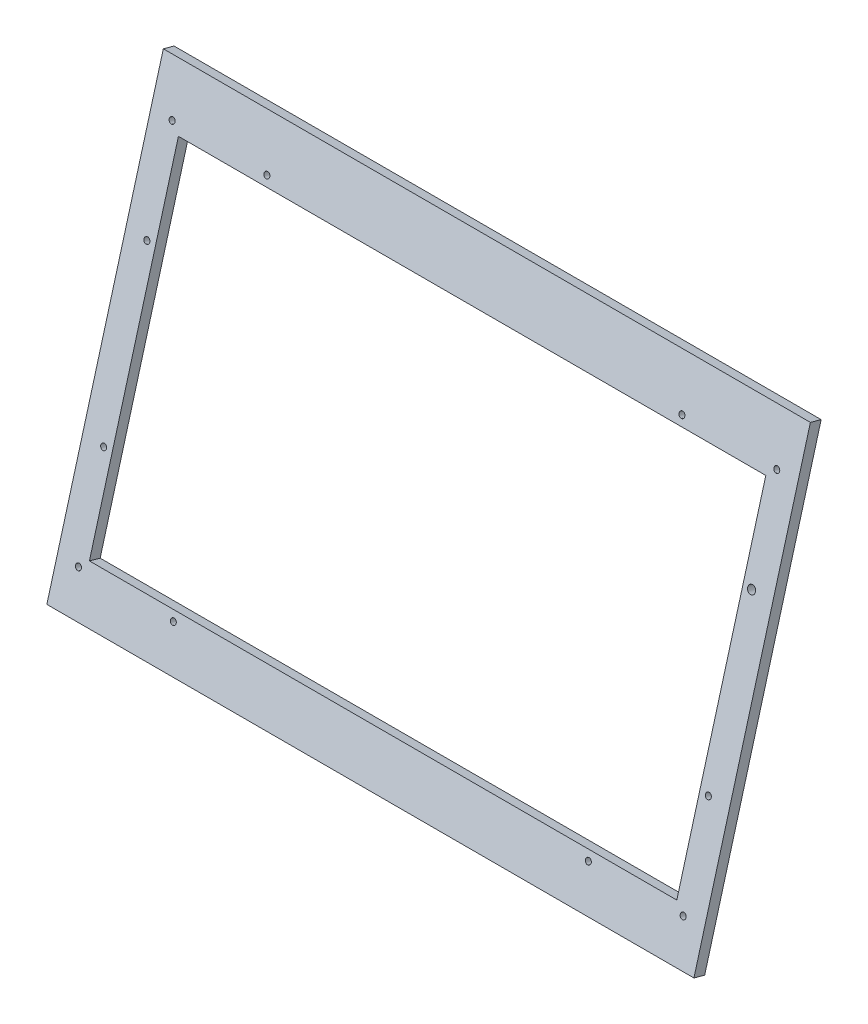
from build123d import *

# Parameters (mm, degrees)
BOSS_EXTRU_3_DEPTH      = 600
ESQUISSE6_W             = 526.5
ESQUISSE6_H             = 300.5
ENL_V_MAT_EXTRU_1_DEPTH = 500
ESQUISSE7_W             = 10
ESQUISSE7_H             = 393.21
ENL_V_MAT_EXTRU_2_DEPTH = 10
ESQUISSE8_R             = 3.52103827
ESQUISSE8_R_2           = 2.6
ENL_V_MAT_EXTRU_3_DEPTH = 10


with BuildPart() as part:
    # Esquisse2 → Boss.-Extru.3 (new body)
    with BuildSketch(Plane(origin=(0, 0, 0), x_dir=(0, 0, -1), z_dir=(1, 0, 0))):
        Polygon((12.126427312, -6.076810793), (-92.272362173, -385.174419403), (-101.913460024, -382.519380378), (2.485329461, -3.421771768), align=None)
    extrude(amount=BOSS_EXTRU_3_DEPTH)

    # Esquisse6 → Enl_v. mat.-Extru.1 (cut)
    with BuildSketch(Plane(origin=(0, -0.877390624, -3.186020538), x_dir=(1, 0, 0), z_dir=(0, 0.26550390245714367, 0.9641097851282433))):
        with Locations((300, -202.639098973)):
            Rectangle(ESQUISSE6_W, ESQUISSE6_H)
    extrude(amount=-ENL_V_MAT_EXTRU_1_DEPTH, mode=Mode.SUBTRACT)

    # Esquisse7 → Enl_v. mat.-Extru.2 (cut)
    with BuildSketch(Plane(origin=(0, -0.877390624, -3.186020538), x_dir=(1, 0, 0), z_dir=(0, 0.26550390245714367, 0.9641097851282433))):
        with Locations((5, -199.244098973)):
            Rectangle(ESQUISSE7_W, ESQUISSE7_H)
        with Locations((595, -199.244098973)):
            Rectangle(ESQUISSE7_W, ESQUISSE7_H)
    extrude(amount=-ENL_V_MAT_EXTRU_2_DEPTH, mode=Mode.SUBTRACT)

    # Esquisse8 → Enl_v. mat.-Extru.3 (cut)
    with BuildSketch(Plane(origin=(0, -3.532429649, -12.827118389), x_dir=(-1, 0, 0), z_dir=(0, -0.26550390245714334, -0.9641097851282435))):
        with Locations(Location((-571, -129.639098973, 0), (0, 0, 90))):
            Circle(ESQUISSE8_R)
        with Locations(Location((-486, -44.639098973, 0), (0, 0, 90))):
            Circle(ESQUISSE8_R_2)
        with Locations(Location((-571, -275.639098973, 0), (0, 0, 90))):
            Circle(ESQUISSE8_R_2)
        with Locations(Location((-486, -360.639098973, 0), (0, 0, 90))):
            Circle(ESQUISSE8_R_2)
        with Locations(Location((-114, -360.639098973, 0), (0, 0, 90))):
            Circle(ESQUISSE8_R_2)
        with Locations(Location((-29, -275.639098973, 0), (0, 0, 90))):
            Circle(ESQUISSE8_R_2)
        with Locations(Location((-29, -129.639098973, 0), (0, 0, 90))):
            Circle(ESQUISSE8_R_2)
        with Locations(Location((-114, -44.639098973, 0), (0, 0, 90))):
            Circle(ESQUISSE8_R_2)
        with Locations(Location((-571, -44.639098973, 0), (0, 0, 90))):
            Circle(ESQUISSE8_R_2)
        with Locations(Location((-571, -360.639098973, 0), (0, 0, 90))):
            Circle(ESQUISSE8_R_2)
        with Locations(Location((-29, -360.639098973, 0), (0, 0, 90))):
            Circle(ESQUISSE8_R_2)
        with Locations(Location((-29, -44.639098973, 0), (0, 0, 90))):
            Circle(ESQUISSE8_R_2)
    extrude(amount=-ENL_V_MAT_EXTRU_3_DEPTH, mode=Mode.SUBTRACT)


solid = part.part
